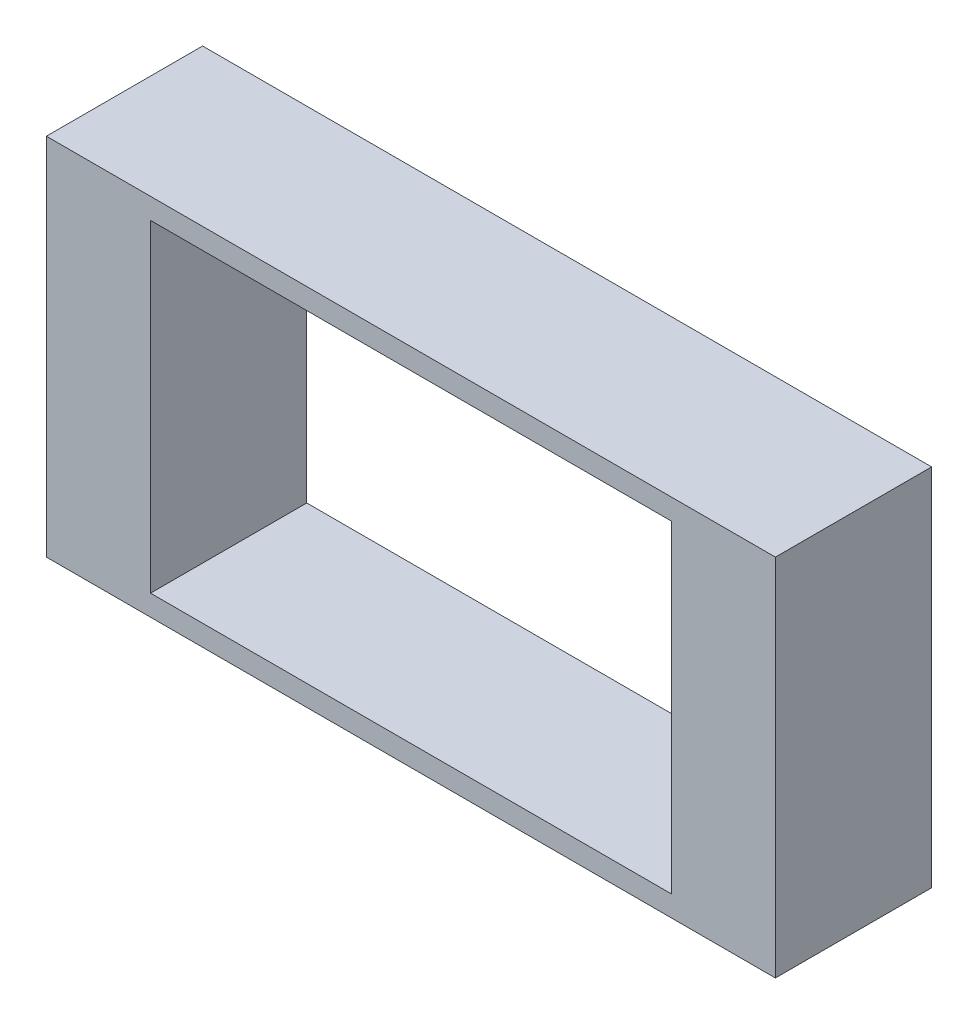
ISO-10303-21;
HEADER;
FILE_DESCRIPTION(('STEP AP214'),'2;1');
FILE_NAME('part.step','',(''),(''),'','','');
FILE_SCHEMA(('AUTOMOTIVE_DESIGN { 1 0 10303 214 1 1 1 1 }'));
ENDSEC;
DATA;
#1=APPLICATION_CONTEXT('core data for automotive mechanical design processes');
#2=APPLICATION_PROTOCOL_DEFINITION('international standard','automotive_design',2000,#1);
#3=PRODUCT_CONTEXT('',#1,'mechanical');
#4=PRODUCT('Part','Part','',(#3));
#5=PRODUCT_RELATED_PRODUCT_CATEGORY('part','',(#4));
#6=PRODUCT_DEFINITION_FORMATION('','',#4);
#7=PRODUCT_DEFINITION_CONTEXT('part definition',#1,'design');
#8=PRODUCT_DEFINITION('design','',#6,#7);
#9=PRODUCT_DEFINITION_SHAPE('','',#8);
#10=(LENGTH_UNIT() NAMED_UNIT(*) SI_UNIT(.MILLI.,.METRE.));
#11=(NAMED_UNIT(*) PLANE_ANGLE_UNIT() SI_UNIT($,.RADIAN.));
#12=(NAMED_UNIT(*) SI_UNIT($,.STERADIAN.) SOLID_ANGLE_UNIT());
#13=UNCERTAINTY_MEASURE_WITH_UNIT(LENGTH_MEASURE(1.E-05),#10,'distance_accuracy_value','');
#14=(GEOMETRIC_REPRESENTATION_CONTEXT(3) GLOBAL_UNCERTAINTY_ASSIGNED_CONTEXT((#13)) GLOBAL_UNIT_ASSIGNED_CONTEXT((#10,
#11,#12)) REPRESENTATION_CONTEXT('',''));
#15=CARTESIAN_POINT('',(0.,0.,0.));
#16=DIRECTION('',(0.,0.,1.));
#17=DIRECTION('',(1.,0.,0.));
#18=AXIS2_PLACEMENT_3D('',#15,#16,#17);
#19=CARTESIAN_POINT('',(0.,0.,15.));
#20=DIRECTION('',(0.,0.,1.));
#21=DIRECTION('',(1.,0.,0.));
#22=AXIS2_PLACEMENT_3D('',#19,#20,#21);
#23=PLANE('',#22);
#24=DIRECTION('',(0.,-1.,0.));
#25=VECTOR('',#24,1.);
#26=CARTESIAN_POINT('',(-35.,17.5,15.));
#27=LINE('',#26,#25);
#28=CARTESIAN_POINT('',(-35.,17.5,15.));
#29=VERTEX_POINT('',#28);
#30=CARTESIAN_POINT('',(-35.,-17.5,15.));
#31=VERTEX_POINT('',#30);
#32=EDGE_CURVE('E134',#29,#31,#27,.T.);
#33=ORIENTED_EDGE('',*,*,#32,.T.);
#34=DIRECTION('',(1.,0.,0.));
#35=VECTOR('',#34,1.);
#36=CARTESIAN_POINT('',(-35.,-17.5,15.));
#37=LINE('',#36,#35);
#38=CARTESIAN_POINT('',(35.,-17.5,15.));
#39=VERTEX_POINT('',#38);
#40=EDGE_CURVE('E137',#31,#39,#37,.T.);
#41=ORIENTED_EDGE('',*,*,#40,.T.);
#42=DIRECTION('',(0.,1.,0.));
#43=VECTOR('',#42,1.);
#44=CARTESIAN_POINT('',(35.,17.5,15.));
#45=LINE('',#44,#43);
#46=CARTESIAN_POINT('',(35.,17.5,15.));
#47=VERTEX_POINT('',#46);
#48=EDGE_CURVE('E140',#39,#47,#45,.T.);
#49=ORIENTED_EDGE('',*,*,#48,.T.);
#50=DIRECTION('',(-1.,0.,0.));
#51=VECTOR('',#50,1.);
#52=CARTESIAN_POINT('',(-35.,17.5,15.));
#53=LINE('',#52,#51);
#54=EDGE_CURVE('E142',#47,#29,#53,.T.);
#55=ORIENTED_EDGE('',*,*,#54,.T.);
#56=EDGE_LOOP('',(#33,#41,#49,#55));
#57=FACE_BOUND('',#56,.T.);
#58=DIRECTION('',(1.,0.,0.));
#59=VECTOR('',#58,1.);
#60=CARTESIAN_POINT('',(-25.,-15.5,15.));
#61=LINE('',#60,#59);
#62=CARTESIAN_POINT('',(-25.,-15.5,15.));
#63=VERTEX_POINT('',#62);
#64=CARTESIAN_POINT('',(25.,-15.5,15.));
#65=VERTEX_POINT('',#64);
#66=EDGE_CURVE('E106',#63,#65,#61,.T.);
#67=ORIENTED_EDGE('',*,*,#66,.F.);
#68=DIRECTION('',(0.,-1.,0.));
#69=VECTOR('',#68,1.);
#70=CARTESIAN_POINT('',(-25.,15.5,15.));
#71=LINE('',#70,#69);
#72=CARTESIAN_POINT('',(-25.,15.5,15.));
#73=VERTEX_POINT('',#72);
#74=EDGE_CURVE('E98',#73,#63,#71,.T.);
#75=ORIENTED_EDGE('',*,*,#74,.F.);
#76=DIRECTION('',(-1.,0.,0.));
#77=VECTOR('',#76,1.);
#78=CARTESIAN_POINT('',(-25.,15.5,15.));
#79=LINE('',#78,#77);
#80=CARTESIAN_POINT('',(25.,15.5,15.));
#81=VERTEX_POINT('',#80);
#82=EDGE_CURVE('E120',#81,#73,#79,.T.);
#83=ORIENTED_EDGE('',*,*,#82,.F.);
#84=DIRECTION('',(0.,1.,0.));
#85=VECTOR('',#84,1.);
#86=CARTESIAN_POINT('',(25.,15.5,15.));
#87=LINE('',#86,#85);
#88=EDGE_CURVE('E118',#65,#81,#87,.T.);
#89=ORIENTED_EDGE('',*,*,#88,.F.);
#90=EDGE_LOOP('',(#67,#75,#83,#89));
#91=FACE_BOUND('',#90,.T.);
#92=ADVANCED_FACE('F33',(#57,#91),#23,.T.);
#93=CARTESIAN_POINT('',(0.,0.,0.));
#94=DIRECTION('',(0.,0.,1.));
#95=DIRECTION('',(1.,0.,0.));
#96=AXIS2_PLACEMENT_3D('',#93,#94,#95);
#97=PLANE('',#96);
#98=DIRECTION('',(0.,-1.,0.));
#99=VECTOR('',#98,1.);
#100=CARTESIAN_POINT('',(-35.,17.5,0.));
#101=LINE('',#100,#99);
#102=CARTESIAN_POINT('',(-35.,17.5,0.));
#103=VERTEX_POINT('',#102);
#104=CARTESIAN_POINT('',(-35.,-17.5,0.));
#105=VERTEX_POINT('',#104);
#106=EDGE_CURVE('E114',#103,#105,#101,.T.);
#107=ORIENTED_EDGE('',*,*,#106,.F.);
#108=DIRECTION('',(-1.,0.,0.));
#109=VECTOR('',#108,1.);
#110=CARTESIAN_POINT('',(-35.,17.5,0.));
#111=LINE('',#110,#109);
#112=CARTESIAN_POINT('',(35.,17.5,0.));
#113=VERTEX_POINT('',#112);
#114=EDGE_CURVE('E138',#113,#103,#111,.T.);
#115=ORIENTED_EDGE('',*,*,#114,.F.);
#116=DIRECTION('',(0.,1.,0.));
#117=VECTOR('',#116,1.);
#118=CARTESIAN_POINT('',(35.,17.5,0.));
#119=LINE('',#118,#117);
#120=CARTESIAN_POINT('',(35.,-17.5,0.));
#121=VERTEX_POINT('',#120);
#122=EDGE_CURVE('E149',#121,#113,#119,.T.);
#123=ORIENTED_EDGE('',*,*,#122,.F.);
#124=DIRECTION('',(1.,0.,0.));
#125=VECTOR('',#124,1.);
#126=CARTESIAN_POINT('',(-35.,-17.5,0.));
#127=LINE('',#126,#125);
#128=EDGE_CURVE('E147',#105,#121,#127,.T.);
#129=ORIENTED_EDGE('',*,*,#128,.F.);
#130=EDGE_LOOP('',(#107,#115,#123,#129));
#131=FACE_BOUND('',#130,.T.);
#132=DIRECTION('',(0.,-1.,0.));
#133=VECTOR('',#132,1.);
#134=CARTESIAN_POINT('',(-25.,15.5,0.));
#135=LINE('',#134,#133);
#136=CARTESIAN_POINT('',(-25.,15.5,0.));
#137=VERTEX_POINT('',#136);
#138=CARTESIAN_POINT('',(-25.,-15.5,0.));
#139=VERTEX_POINT('',#138);
#140=EDGE_CURVE('E56',#137,#139,#135,.T.);
#141=ORIENTED_EDGE('',*,*,#140,.T.);
#142=DIRECTION('',(1.,0.,0.));
#143=VECTOR('',#142,1.);
#144=CARTESIAN_POINT('',(-25.,-15.5,0.));
#145=LINE('',#144,#143);
#146=CARTESIAN_POINT('',(25.,-15.5,0.));
#147=VERTEX_POINT('',#146);
#148=EDGE_CURVE('E113',#139,#147,#145,.T.);
#149=ORIENTED_EDGE('',*,*,#148,.T.);
#150=DIRECTION('',(0.,1.,0.));
#151=VECTOR('',#150,1.);
#152=CARTESIAN_POINT('',(25.,15.5,0.));
#153=LINE('',#152,#151);
#154=CARTESIAN_POINT('',(25.,15.5,0.));
#155=VERTEX_POINT('',#154);
#156=EDGE_CURVE('E126',#147,#155,#153,.T.);
#157=ORIENTED_EDGE('',*,*,#156,.T.);
#158=DIRECTION('',(-1.,0.,0.));
#159=VECTOR('',#158,1.);
#160=CARTESIAN_POINT('',(-25.,15.5,0.));
#161=LINE('',#160,#159);
#162=EDGE_CURVE('E107',#155,#137,#161,.T.);
#163=ORIENTED_EDGE('',*,*,#162,.T.);
#164=EDGE_LOOP('',(#141,#149,#157,#163));
#165=FACE_BOUND('',#164,.T.);
#166=ADVANCED_FACE('F167',(#131,#165),#97,.F.);
#167=CARTESIAN_POINT('',(-35.,17.5,15.));
#168=DIRECTION('',(1.,0.,0.));
#169=DIRECTION('',(0.,1.,0.));
#170=AXIS2_PLACEMENT_3D('',#167,#168,#169);
#171=PLANE('',#170);
#172=ORIENTED_EDGE('',*,*,#106,.T.);
#173=DIRECTION('',(0.,0.,-1.));
#174=VECTOR('',#173,1.);
#175=CARTESIAN_POINT('',(-35.,-17.5,15.));
#176=LINE('',#175,#174);
#177=EDGE_CURVE('E11',#31,#105,#176,.T.);
#178=ORIENTED_EDGE('',*,*,#177,.F.);
#179=ORIENTED_EDGE('',*,*,#32,.F.);
#180=DIRECTION('',(0.,0.,-1.));
#181=VECTOR('',#180,1.);
#182=CARTESIAN_POINT('',(-35.,17.5,15.));
#183=LINE('',#182,#181);
#184=EDGE_CURVE('E144',#29,#103,#183,.T.);
#185=ORIENTED_EDGE('',*,*,#184,.T.);
#186=EDGE_LOOP('',(#172,#178,#179,#185));
#187=FACE_BOUND('',#186,.T.);
#188=ADVANCED_FACE('F35',(#187),#171,.F.);
#189=CARTESIAN_POINT('',(-35.,-17.5,15.));
#190=DIRECTION('',(0.,1.,0.));
#191=DIRECTION('',(-1.,0.,0.));
#192=AXIS2_PLACEMENT_3D('',#189,#190,#191);
#193=PLANE('',#192);
#194=ORIENTED_EDGE('',*,*,#128,.T.);
#195=DIRECTION('',(0.,0.,-1.));
#196=VECTOR('',#195,1.);
#197=CARTESIAN_POINT('',(35.,-17.5,15.));
#198=LINE('',#197,#196);
#199=EDGE_CURVE('E41',#39,#121,#198,.T.);
#200=ORIENTED_EDGE('',*,*,#199,.F.);
#201=ORIENTED_EDGE('',*,*,#40,.F.);
#202=ORIENTED_EDGE('',*,*,#177,.T.);
#203=EDGE_LOOP('',(#194,#200,#201,#202));
#204=FACE_BOUND('',#203,.T.);
#205=ADVANCED_FACE('F177',(#204),#193,.F.);
#206=CARTESIAN_POINT('',(35.,17.5,15.));
#207=DIRECTION('',(-1.,0.,0.));
#208=DIRECTION('',(0.,-1.,0.));
#209=AXIS2_PLACEMENT_3D('',#206,#207,#208);
#210=PLANE('',#209);
#211=ORIENTED_EDGE('',*,*,#122,.T.);
#212=DIRECTION('',(0.,0.,-1.));
#213=VECTOR('',#212,1.);
#214=CARTESIAN_POINT('',(35.,17.5,15.));
#215=LINE('',#214,#213);
#216=EDGE_CURVE('E154',#47,#113,#215,.T.);
#217=ORIENTED_EDGE('',*,*,#216,.F.);
#218=ORIENTED_EDGE('',*,*,#48,.F.);
#219=ORIENTED_EDGE('',*,*,#199,.T.);
#220=EDGE_LOOP('',(#211,#217,#218,#219));
#221=FACE_BOUND('',#220,.T.);
#222=ADVANCED_FACE('F161',(#221),#210,.F.);
#223=CARTESIAN_POINT('',(-35.,17.5,15.));
#224=DIRECTION('',(0.,-1.,0.));
#225=DIRECTION('',(0.,0.,-1.));
#226=AXIS2_PLACEMENT_3D('',#223,#224,#225);
#227=PLANE('',#226);
#228=ORIENTED_EDGE('',*,*,#114,.T.);
#229=ORIENTED_EDGE('',*,*,#184,.F.);
#230=ORIENTED_EDGE('',*,*,#54,.F.);
#231=ORIENTED_EDGE('',*,*,#216,.T.);
#232=EDGE_LOOP('',(#228,#229,#230,#231));
#233=FACE_BOUND('',#232,.T.);
#234=ADVANCED_FACE('F171',(#233),#227,.F.);
#235=CARTESIAN_POINT('',(-25.,15.5,15.));
#236=DIRECTION('',(1.,0.,0.));
#237=DIRECTION('',(0.,1.,0.));
#238=AXIS2_PLACEMENT_3D('',#235,#236,#237);
#239=PLANE('',#238);
#240=ORIENTED_EDGE('',*,*,#140,.F.);
#241=DIRECTION('',(0.,0.,-1.));
#242=VECTOR('',#241,1.);
#243=CARTESIAN_POINT('',(-25.,15.5,15.));
#244=LINE('',#243,#242);
#245=EDGE_CURVE('E102',#73,#137,#244,.T.);
#246=ORIENTED_EDGE('',*,*,#245,.F.);
#247=ORIENTED_EDGE('',*,*,#74,.T.);
#248=DIRECTION('',(0.,0.,-1.));
#249=VECTOR('',#248,1.);
#250=CARTESIAN_POINT('',(-25.,-15.5,15.));
#251=LINE('',#250,#249);
#252=EDGE_CURVE('E101',#63,#139,#251,.T.);
#253=ORIENTED_EDGE('',*,*,#252,.T.);
#254=EDGE_LOOP('',(#240,#246,#247,#253));
#255=FACE_BOUND('',#254,.T.);
#256=ADVANCED_FACE('F100',(#255),#239,.T.);
#257=CARTESIAN_POINT('',(-25.,-15.5,15.));
#258=DIRECTION('',(0.,1.,0.));
#259=DIRECTION('',(0.,0.,1.));
#260=AXIS2_PLACEMENT_3D('',#257,#258,#259);
#261=PLANE('',#260);
#262=ORIENTED_EDGE('',*,*,#148,.F.);
#263=ORIENTED_EDGE('',*,*,#252,.F.);
#264=ORIENTED_EDGE('',*,*,#66,.T.);
#265=DIRECTION('',(0.,0.,-1.));
#266=VECTOR('',#265,1.);
#267=CARTESIAN_POINT('',(25.,-15.5,15.));
#268=LINE('',#267,#266);
#269=EDGE_CURVE('E115',#65,#147,#268,.T.);
#270=ORIENTED_EDGE('',*,*,#269,.T.);
#271=EDGE_LOOP('',(#262,#263,#264,#270));
#272=FACE_BOUND('',#271,.T.);
#273=ADVANCED_FACE('F110',(#272),#261,.T.);
#274=CARTESIAN_POINT('',(25.,15.5,15.));
#275=DIRECTION('',(-1.,0.,0.));
#276=DIRECTION('',(0.,-1.,0.));
#277=AXIS2_PLACEMENT_3D('',#274,#275,#276);
#278=PLANE('',#277);
#279=ORIENTED_EDGE('',*,*,#156,.F.);
#280=ORIENTED_EDGE('',*,*,#269,.F.);
#281=ORIENTED_EDGE('',*,*,#88,.T.);
#282=DIRECTION('',(0.,0.,-1.));
#283=VECTOR('',#282,1.);
#284=CARTESIAN_POINT('',(25.,15.5,15.));
#285=LINE('',#284,#283);
#286=EDGE_CURVE('E48',#81,#155,#285,.T.);
#287=ORIENTED_EDGE('',*,*,#286,.T.);
#288=EDGE_LOOP('',(#279,#280,#281,#287));
#289=FACE_BOUND('',#288,.T.);
#290=ADVANCED_FACE('F200',(#289),#278,.T.);
#291=CARTESIAN_POINT('',(-25.,15.5,15.));
#292=DIRECTION('',(0.,-1.,0.));
#293=DIRECTION('',(0.,0.,-1.));
#294=AXIS2_PLACEMENT_3D('',#291,#292,#293);
#295=PLANE('',#294);
#296=ORIENTED_EDGE('',*,*,#162,.F.);
#297=ORIENTED_EDGE('',*,*,#286,.F.);
#298=ORIENTED_EDGE('',*,*,#82,.T.);
#299=ORIENTED_EDGE('',*,*,#245,.T.);
#300=EDGE_LOOP('',(#296,#297,#298,#299));
#301=FACE_BOUND('',#300,.T.);
#302=ADVANCED_FACE('F204',(#301),#295,.T.);
#303=CLOSED_SHELL('',(#92,#166,#188,#205,#222,#234,#256,#273,#290,#302));
#304=MANIFOLD_SOLID_BREP('B2',#303);
#305=ADVANCED_BREP_SHAPE_REPRESENTATION('',(#18,#304),#14);
#306=SHAPE_DEFINITION_REPRESENTATION(#9,#305);
ENDSEC;
END-ISO-10303-21;
